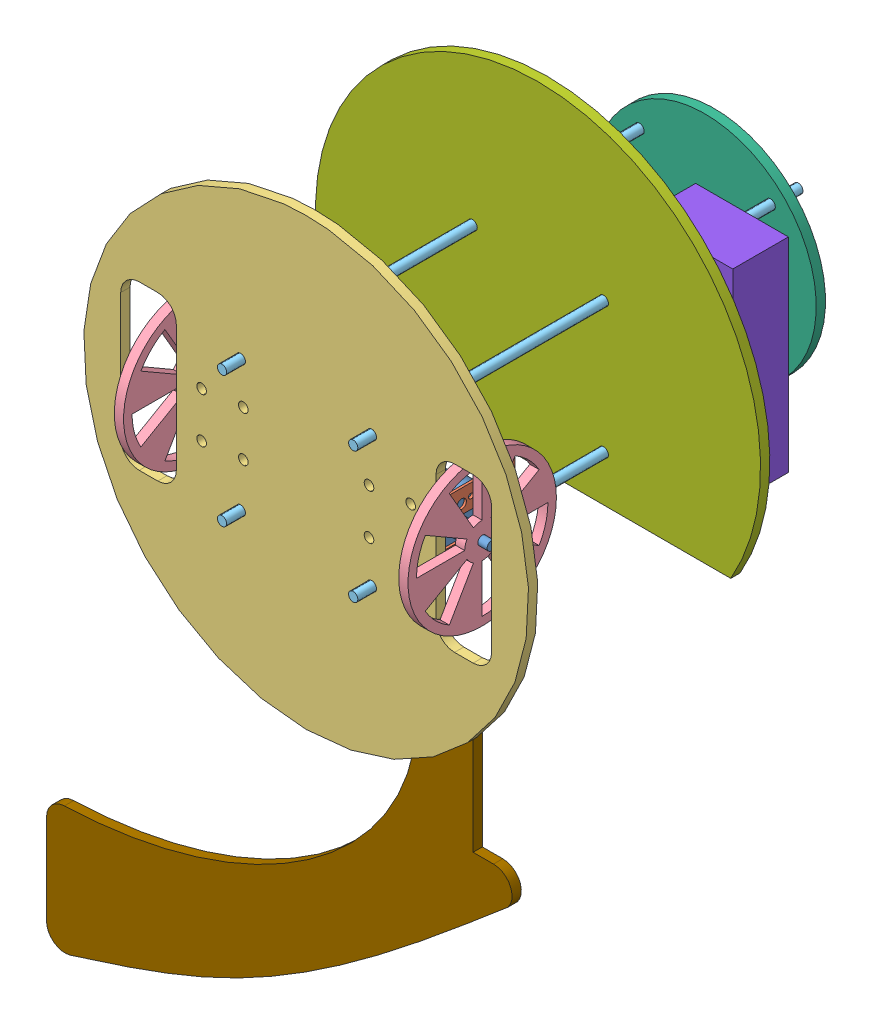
SolidWorks assembly roller wheel + hub + motor + base_v3.SLDASM, configuration Default (file format 3800). Lengths in mm.
Overall size (336.55 526.26 322.91).
18 component instances, 9 part files, 35 mates.
Components (placement in the parent):
- dc motor - jameco_161382-1: dc motor - jameco_161382.SLDPRT [Default] at (-23.1125 8.981 -29.4197) x (0 0 1) z (-1 0 0) size (37 37 63.9)
- L channel _bracket style-1: L channel _bracket style.SLDPRT [Default] at (26.1 -14.4564 9.7178) size (50.8 15.88 50.8)
- L channel _bracket style-2: L channel _bracket style.SLDPRT [Default] at (26.1 16.5435 9.7178) size (50.8 15.88 50.8)
- Base plate_v2-1: Base plate_v2.SLDPRT [Default] at (61.1938 8.9811 16.0678) x (1 0 0) z (0 1 0) size (304.8 6.35 304.8)
- roller wheel + hub + motor-1: roller wheel + hub + motor.SLDASM [Default] at (122.3877 17.9621 0) x (-1 0 0) z (0 0 1) size (71.81 101.6 101.6)
  - dc motor - jameco_161382-1: dc motor - jameco_161382.SLDPRT [Default] at (-23.1125 8.981 -29.4197) x (0 0 1) z (-1 0 0) size (37 37 63.9)
  - L channel _bracket style-1: L channel _bracket style.SLDPRT [Default] at (26.1 -14.4565 9.7178) size (50.8 15.88 50.8)
  - L channel _bracket style-2: L channel _bracket style.SLDPRT [Default] at (26.1 16.5435 9.7178) size (50.8 15.88 50.8)
  - acrylic wheel 4in diameter-1: acrylic wheel 4in diameter.SLDPRT [Default] at (-39.3625 8.981 -3.9197) x (0 -1 0) z (0 0 1) size (101.6 6.35 101.6)
- all-thread rod-1: all-thread rod.SLDPRT [Default] at (16.2925 53.8823 28.7678) x (1 0 0) z (0 1 0) size (6.35 304.8 6.35)
- all-thread rod-2: all-thread rod.SLDPRT [Default] at (106.0951 53.8823 28.7678) x (1 0 0) z (0 1 0) size (6.35 304.8 6.35)
- all-thread rod-3: all-thread rod.SLDPRT [Default] at (16.2925 -35.9202 28.7678) x (1 0 0) z (0 1 0) size (6.35 304.8 6.35)
- all-thread rod-4: all-thread rod.SLDPRT [Default] at (106.0951 -35.9202 28.7678) x (1 0 0) z (0 1 0) size (6.35 304.8 6.35)
- top platform for beacon-1: top platform for beacon.SLDPRT [Default] at (61.1938 8.9811 -263.3322) size (152.4 152.4 6.35)
- second level deck-1: second level deck.SLDPRT [Default] at (61.1938 8.9811 -142.6822) x (1 0 0) z (0 1 0) size (304.8 6.35 228.6)
- door lock motor-1: door lock motor.SLDPRT [Default] at (124.6938 -29.1189 -187.1322) x (0 -1 0) z (-1 0 0) size (139.7 38.1 63.5)
- ski v3-1: ski v3.SLDPRT [Default] at (181.8011 -100.242 9.7178) x (1 0 0) z (0 1 0) size (318.78 6.35 290.04)
- acrylic wheel 4in diameter-1: acrylic wheel 4in diameter.SLDPRT [Default] at (-39.3625 8.981 -3.9197) x (0 -1 0) z (0 0 1) size (101.6 6.35 101.6)
Mates (geometry in assembly coordinates):
- Concentric7: concentric anti-aligned: cylinder of dc motor - jameco_161382-1; cylinder of L channel _bracket style-1
- Coincident3: coincident anti-aligned: plane of dc motor - jameco_161382-1 through (-23.1125 8.981 -10.9197) normal (-1 0 0); plane of L channel _bracket style-1 through (-23.1125 1.4186 -41.0822) normal (1 0 0)
- Concentric8: concentric anti-aligned: cylinder of dc motor - jameco_161382-1; cylinder of L channel _bracket style-2
- Coincident4: coincident anti-aligned: plane of dc motor - jameco_161382-1 through (-23.1125 8.981 -10.9197) normal (-1 0 0); plane of L channel _bracket style-2 through (-23.1125 32.4185 -41.0822) normal (1 0 0)
- Parallel1: parallel aligned: plane of L channel _bracket style-1 through (26.1 1.4186 9.7178) normal (0 0 1); plane of L channel _bracket style-2 through (26.1 32.4185 9.7178) normal (0 0 1)
- Coincident5: coincident anti-aligned: plane of L channel _bracket style-2 through (26.1 32.4185 9.7178) normal (0 0 1); plane of Base plate_v2-1 through (-274.2276 8.9811 9.7178) normal (0 0 -1)
- Concentric9: concentric anti-aligned: cylinder of L channel _bracket style-2; cylinder of Base plate_v2-1
- Concentric10: concentric anti-aligned: cylinder of L channel _bracket style-1; cylinder of Base plate_v2-1
- Concentric11: concentric anti-aligned: cylinder of L channel _bracket style-2; cylinder of Base plate_v2-1
- Concentric12: concentric anti-aligned: cylinder of L channel _bracket style-1; cylinder of Base plate_v2-1
- Coincident6: coincident anti-aligned: plane of Base plate_v2-1 through (-274.2276 8.9811 9.7178) normal (0 0 -1); plane of roller wheel + hub + motor-1/L channel _bracket style-2 through (96.2876 -14.4564 9.7178) normal (0 0 1)
- Concentric14: concentric anti-aligned: cylinder of Base plate_v2-1; cylinder of roller wheel + hub + motor-1/L channel _bracket style-2
- Concentric15: concentric anti-aligned: cylinder of Base plate_v2-1; cylinder of roller wheel + hub + motor-1/L channel _bracket style-1
- Concentric16: concentric anti-aligned: cylinder of Base plate_v2-1; cylinder of all-thread rod-1
- Distance4: distance = 12.7 mm aligned: plane of all-thread rod-1 through (16.2925 53.8823 28.7678) normal (0 0 1); plane of Base plate_v2-1 through (-274.2276 8.9811 16.0678) normal (0 0 1)
- Concentric17: concentric anti-aligned: cylinder of Base plate_v2-1; cylinder of all-thread rod-2
- Distance5: distance = 12.7 mm aligned: plane of all-thread rod-2 through (106.0951 53.8823 28.7678) normal (0 0 1); plane of Base plate_v2-1 through (-274.2276 8.9811 16.0678) normal (0 0 1)
- Concentric18: concentric anti-aligned: cylinder of Base plate_v2-1; cylinder of all-thread rod-3
- Distance6: distance = 12.7 mm aligned: plane of all-thread rod-3 through (16.2925 -35.9202 28.7678) normal (0 0 1); plane of Base plate_v2-1 through (-274.2276 8.9811 16.0678) normal (0 0 1)
- Concentric19: concentric anti-aligned: cylinder of Base plate_v2-1; cylinder of all-thread rod-4
- Distance7: distance = 12.7 mm aligned: plane of all-thread rod-4 through (106.0951 -35.9202 28.7678) normal (0 0 1); plane of Base plate_v2-1 through (-274.2276 8.9811 16.0678) normal (0 0 1)
- Concentric20: concentric aligned: cylinder of all-thread rod-1; cylinder of top platform for beacon-1
- Concentric21: concentric aligned: cylinder of all-thread rod-2; circle of top platform for beacon-1
- Distance8: distance = 12.7 mm aligned: plane of top platform for beacon-1 through (61.1938 8.9811 -263.3322) normal (0 0 -1); plane of all-thread rod-2 through (106.0951 53.8823 -276.0322) normal (0 0 -1)
- Concentric22: concentric anti-aligned: cylinder of all-thread rod-3; cylinder of second level deck-1
- Concentric23: concentric anti-aligned: cylinder of all-thread rod-1; cylinder of second level deck-1
- Distance9: distance = 152.4 mm anti-aligned: plane of second level deck-1 through (61.1938 8.9811 -142.6822) normal (0 0 1); plane of Base plate_v2-1 through (-274.2276 8.9811 9.7178) normal (0 0 -1)
- Coincident14: coincident anti-aligned: plane of second level deck-1 through (61.1938 8.9811 -149.0322) normal (0 0 -1); plane of door lock motor-1 through (188.1938 -29.1189 -149.0322) normal (0 0 1)
- Distance11: distance = 38.1 mm aligned: plane of door lock motor-1 through (124.6938 -29.1189 -149.0322) normal (0 -1 0); plane of second level deck-1 through (-70.7884 -67.2189 -149.0322) normal (0 -1 0)
- Distance12: distance = 25.4 mm aligned: plane of door lock motor-1 through (188.1938 -29.1189 -149.0322) normal (1 0 0); cylinder of second level deck-1
- Coincident15: coincident anti-aligned: plane of Base plate_v2-1 through (-274.2276 8.9811 9.7178) normal (0 0 -1); plane of ski v3-1 through (183.1217 -178.1344 9.7178) normal (0 0 1)
- Distance15: distance = 7.62 mm anti-aligned: plane of ski v3-1 through (131.0467 -74.8389 3.3678) normal (0 1 0); plane of second level deck-1 through (-70.7884 -67.2189 -149.0322) normal (0 -1 0)
- Distance17: distance = 19.05 mm anti-aligned: plane of ski v3-1 through (169.1438 -100.242 3.3678) normal (1 0 0); plane of Base plate_v2-1 through (188.1938 8.9811 9.7178) normal (-1 0 0)
- Concentric24: concentric anti-aligned: cylinder of dc motor - jameco_161382-1; cylinder of acrylic wheel 4in diameter-1
- Distance18: distance = 12.7 mm anti-aligned: plane of acrylic wheel 4in diameter-1 through (-33.0125 8.981 -3.9197) normal (1 0 0); plane of dc motor - jameco_161382-1 through (-45.7125 8.981 -3.9197) normal (-1 0 0)
